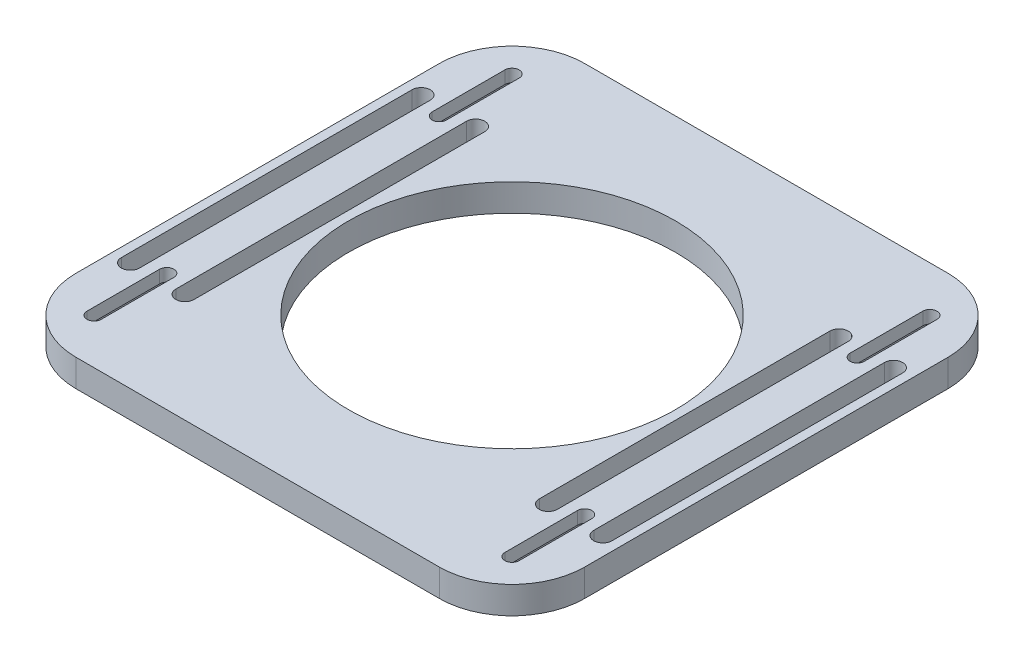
from build123d import *

# Parameters (mm, degrees)
SKETCH1_W           = 177.8
SKETCH1_H           = 177.8
SKETCH1_R           = 57.15
BOSS_EXTRUDE1_DEPTH = 9.525
FILLET1_R           = 25.4
CUT_EXTRUDE1_DEPTH  = 6.35
CUT_EXTRUDE2_DEPTH  = 127.083883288
CUT_EXTRUDE3_DEPTH  = 5.08


with BuildPart() as part:
    # Sketch1 → Boss-Extrude1 (new body)
    with BuildSketch(Plane(origin=(0, 0, 0), x_dir=(1, 0, 0), z_dir=(0, 1, 0))):
        Rectangle(SKETCH1_W, SKETCH1_H)
        with Locations(Location((0, 0, 0), (0, 0, 90))):
            Circle(SKETCH1_R, mode=Mode.SUBTRACT)
    extrude(amount=BOSS_EXTRUDE1_DEPTH)

    # Fillet1
    fillet1_edges = [part.edges().sort_by_distance(p)[0] for p in [
        (88.9, 4.7625, 88.9),
        (-88.9, 4.7625, 88.9),
        (-88.9, 4.7625, -88.9),
        (88.9, 4.7625, -88.9),
    ]]
    fillet(fillet1_edges, radius=FILLET1_R)

    # Sketch2 → Cut-Extrude1 (cut)
    with BuildSketch(Plane(origin=(0, 9.525, 0), x_dir=(1, 0, 0), z_dir=(0, 1, 0))):
        with BuildLine():
            Line((85.725, 50.8), (85.725, -50.8))
            ThreePointArc((85.725, -50.8), (82.55, -53.975), (79.375, -50.8))
            Line((79.375, -50.8), (79.375, 50.8))
            ThreePointArc((79.375, 50.8), (82.55, 53.975), (85.725, 50.8))
        make_face()
        with BuildLine():
            Line((60.325, 50.8), (60.325, -50.8))
            ThreePointArc((60.325, -50.8), (63.5, -53.975), (66.675, -50.8))
            Line((66.675, -50.8), (66.675, 50.8))
            ThreePointArc((66.675, 50.8), (63.5, 53.975), (60.325, 50.8))
        make_face()
        with BuildLine():
            Line((-85.725, 50.8), (-85.725, -50.8))
            ThreePointArc((-85.725, -50.8), (-82.55, -53.975), (-79.375, -50.8))
            Line((-79.375, -50.8), (-79.375, 50.8))
            ThreePointArc((-79.375, 50.8), (-82.55, 53.975), (-85.725, 50.8))
        make_face()
        with BuildLine():
            Line((-60.325, 50.8), (-60.325, -50.8))
            ThreePointArc((-60.325, -50.8), (-63.5, -53.975), (-66.675, -50.8))
            Line((-66.675, -50.8), (-66.675, 50.8))
            ThreePointArc((-66.675, 50.8), (-63.5, 53.975), (-60.325, 50.8))
        make_face()
    extrude(amount=-CUT_EXTRUDE1_DEPTH, mode=Mode.SUBTRACT)

    # Sketch3 → Cut-Extrude2 (cut, through all)
    with BuildSketch(Plane(origin=(0, 9.525, 0), x_dir=(1, 0, 0), z_dir=(0, 1, 0))):
        with BuildLine():
            Line((70.5358, -73.025), (70.5358, -47.625))
            ThreePointArc((70.5358, -47.625), (73.025, -45.1358), (75.5142, -47.625))
            Line((75.5142, -47.625), (75.5142, -73.025))
            ThreePointArc((75.5142, -73.025), (73.025, -75.5142), (70.5358, -73.025))
        make_face()
        with BuildLine():
            Line((70.5358, 73.025), (70.5358, 47.625))
            ThreePointArc((70.5358, 47.625), (73.025, 45.1358), (75.5142, 47.625))
            Line((75.5142, 47.625), (75.5142, 73.025))
            ThreePointArc((75.5142, 73.025), (73.025, 75.5142), (70.5358, 73.025))
        make_face()
        with BuildLine():
            Line((-70.5358, -73.025), (-70.5358, -47.625))
            ThreePointArc((-70.5358, -47.625), (-73.025, -45.1358), (-75.5142, -47.625))
            Line((-75.5142, -47.625), (-75.5142, -73.025))
            ThreePointArc((-75.5142, -73.025), (-73.025, -75.5142), (-70.5358, -73.025))
        make_face()
        with BuildLine():
            Line((-70.5358, 73.025), (-70.5358, 47.625))
            ThreePointArc((-70.5358, 47.625), (-73.025, 45.1358), (-75.5142, 47.625))
            Line((-75.5142, 47.625), (-75.5142, 73.025))
            ThreePointArc((-75.5142, 73.025), (-73.025, 75.5142), (-70.5358, 73.025))
        make_face()
    extrude(amount=-CUT_EXTRUDE2_DEPTH, mode=Mode.SUBTRACT)

    # Sketch4 → Cut-Extrude3 (cut)
    with BuildSketch(Plane.XZ):
        with BuildLine():
            Line((77.47, 73.025), (77.47, 47.625))
            ThreePointArc((77.47, 47.625), (73.025, 43.18), (68.58, 47.625))
            Line((68.58, 47.625), (68.58, 73.025))
            ThreePointArc((68.58, 73.025), (73.025, 77.47), (77.47, 73.025))
        make_face()
        with BuildLine():
            Line((-77.47, 73.025), (-77.47, 47.625))
            ThreePointArc((-77.47, 47.625), (-73.025, 43.18), (-68.58, 47.625))
            Line((-68.58, 47.625), (-68.58, 73.025))
            ThreePointArc((-68.58, 73.025), (-73.025, 77.47), (-77.47, 73.025))
        make_face()
        with BuildLine():
            Line((77.47, -73.025), (77.47, -47.625))
            ThreePointArc((77.47, -47.625), (73.025, -43.18), (68.58, -47.625))
            Line((68.58, -47.625), (68.58, -73.025))
            ThreePointArc((68.58, -73.025), (73.025, -77.47), (77.47, -73.025))
        make_face()
        with BuildLine():
            Line((-77.47, -73.025), (-77.47, -47.625))
            ThreePointArc((-77.47, -47.625), (-73.025, -43.18), (-68.58, -47.625))
            Line((-68.58, -47.625), (-68.58, -73.025))
            ThreePointArc((-68.58, -73.025), (-73.025, -77.47), (-77.47, -73.025))
        make_face()
    extrude(amount=-CUT_EXTRUDE3_DEPTH, mode=Mode.SUBTRACT)


solid = part.part
